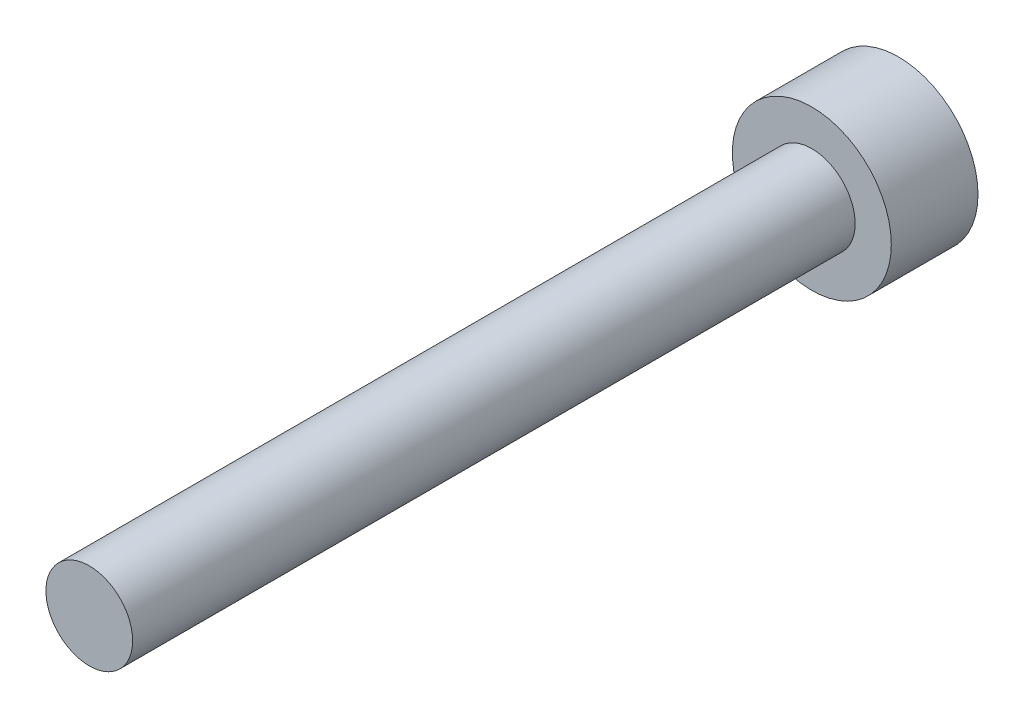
from build123d import *

# Parameters (mm, degrees)
HEAD_ENVELOPE_START             = -3
SKETCH_1_R                      = 2.75
HEAD_ENVELOPE_DEPTH             = 3
SKETCH_2_R                      = 1.5
SHANK_ENVELOPE_NO_THREADS_DEPTH = 25


with BuildPart() as part:
    # Sketch 1 → Head_envelope (new body)
    with BuildSketch(Plane.XY.offset(HEAD_ENVELOPE_START)):
        Circle(SKETCH_1_R)
    extrude(amount=HEAD_ENVELOPE_DEPTH)

    # Sketch 2 → Shank_envelope_no_threads (add)
    with BuildSketch(Plane.XY):
        Circle(SKETCH_2_R)
    extrude(amount=SHANK_ENVELOPE_NO_THREADS_DEPTH)


solid = part.part
